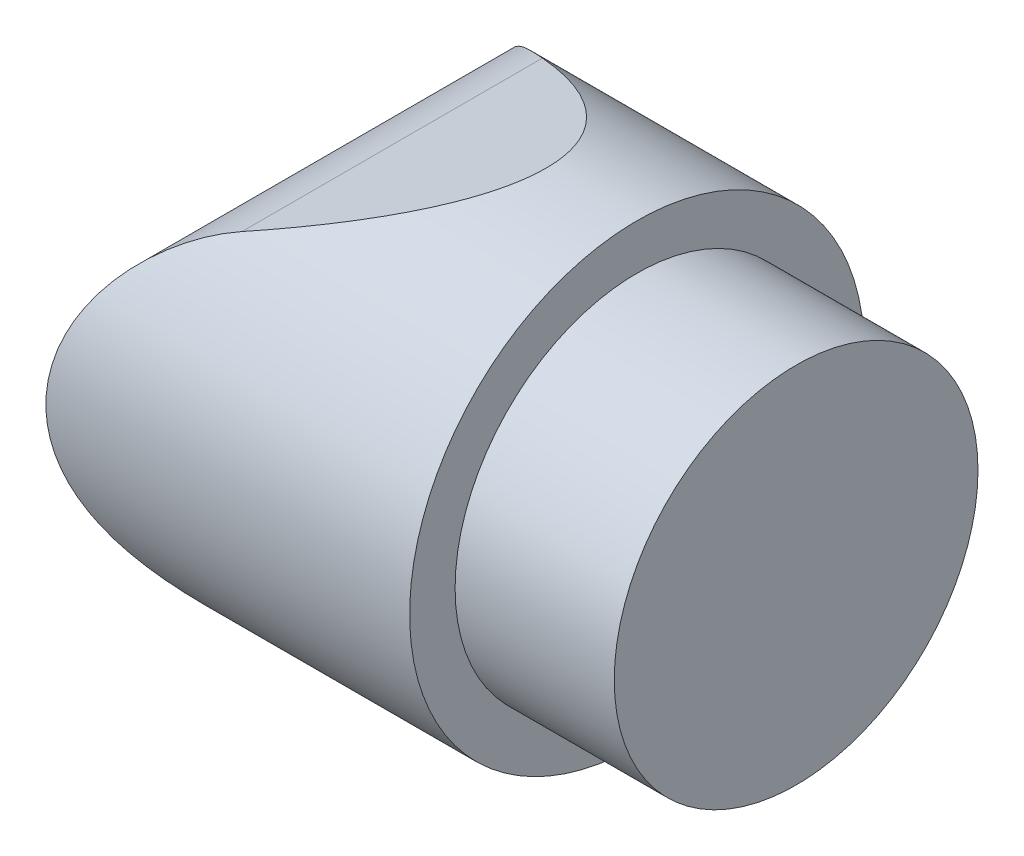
ISO-10303-21;
HEADER;
FILE_DESCRIPTION(('STEP AP214'),'2;1');
FILE_NAME('part.step','',(''),(''),'','','');
FILE_SCHEMA(('AUTOMOTIVE_DESIGN { 1 0 10303 214 1 1 1 1 }'));
ENDSEC;
DATA;
#1=APPLICATION_CONTEXT('core data for automotive mechanical design processes');
#2=APPLICATION_PROTOCOL_DEFINITION('international standard','automotive_design',2000,#1);
#3=PRODUCT_CONTEXT('',#1,'mechanical');
#4=PRODUCT('Part','Part','',(#3));
#5=PRODUCT_RELATED_PRODUCT_CATEGORY('part','',(#4));
#6=PRODUCT_DEFINITION_FORMATION('','',#4);
#7=PRODUCT_DEFINITION_CONTEXT('part definition',#1,'design');
#8=PRODUCT_DEFINITION('design','',#6,#7);
#9=PRODUCT_DEFINITION_SHAPE('','',#8);
#10=(LENGTH_UNIT() NAMED_UNIT(*) SI_UNIT(.MILLI.,.METRE.));
#11=(NAMED_UNIT(*) PLANE_ANGLE_UNIT() SI_UNIT($,.RADIAN.));
#12=(NAMED_UNIT(*) SI_UNIT($,.STERADIAN.) SOLID_ANGLE_UNIT());
#13=UNCERTAINTY_MEASURE_WITH_UNIT(LENGTH_MEASURE(1.E-05),#10,'distance_accuracy_value','');
#14=(GEOMETRIC_REPRESENTATION_CONTEXT(3) GLOBAL_UNCERTAINTY_ASSIGNED_CONTEXT((#13)) GLOBAL_UNIT_ASSIGNED_CONTEXT((#10,
#11,#12)) REPRESENTATION_CONTEXT('',''));
#15=CARTESIAN_POINT('',(0.,0.,0.));
#16=DIRECTION('',(0.,0.,1.));
#17=DIRECTION('',(1.,0.,0.));
#18=AXIS2_PLACEMENT_3D('',#15,#16,#17);
#19=CARTESIAN_POINT('',(0.,0.,-110.141421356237));
#20=DIRECTION('',(1.,0.,0.));
#21=DIRECTION('',(0.,0.,-1.));
#22=AXIS2_PLACEMENT_3D('',#19,#20,#21);
#23=PLANE('',#22);
#24=CARTESIAN_POINT('',(0.,0.,0.));
#25=DIRECTION('',(1.,0.,0.));
#26=DIRECTION('',(0.,0.,-1.));
#27=AXIS2_PLACEMENT_3D('',#24,#25,#26);
#28=CIRCLE('',#27,50.);
#29=CARTESIAN_POINT('',(0.,0.,-50.));
#30=VERTEX_POINT('',#29);
#31=EDGE_CURVE('E62',#30,#30,#28,.T.);
#32=ORIENTED_EDGE('',*,*,#31,.T.);
#33=EDGE_LOOP('',(#32));
#34=FACE_BOUND('',#33,.T.);
#35=CARTESIAN_POINT('',(0.,0.,0.));
#36=DIRECTION('',(1.,0.,0.));
#37=DIRECTION('',(0.,0.,-1.));
#38=AXIS2_PLACEMENT_3D('',#35,#36,#37);
#39=CIRCLE('',#38,40.);
#40=CARTESIAN_POINT('',(0.,0.,-40.));
#41=VERTEX_POINT('',#40);
#42=EDGE_CURVE('E70',#41,#41,#39,.T.);
#43=ORIENTED_EDGE('',*,*,#42,.F.);
#44=EDGE_LOOP('',(#43));
#45=FACE_BOUND('',#44,.T.);
#46=ADVANCED_FACE('F31',(#34,#45),#23,.T.);
#47=CARTESIAN_POINT('',(-100.,0.,0.));
#48=DIRECTION('',(1.,0.,0.));
#49=DIRECTION('',(0.,0.,-1.));
#50=AXIS2_PLACEMENT_3D('',#47,#48,#49);
#51=CYLINDRICAL_SURFACE('',#50,50.);
#52=CARTESIAN_POINT('',(-53.8313881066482,-37.5325552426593,33.0349405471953));
#53=CARTESIAN_POINT('',(-54.4122214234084,-37.3184792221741,33.2781937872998));
#54=CARTESIAN_POINT('',(-54.9846616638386,-37.0922393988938,33.5304396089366));
#55=CARTESIAN_POINT('',(-56.1127283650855,-36.6163241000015,34.04949578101));
#56=CARTESIAN_POINT('',(-56.6683600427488,-36.3666559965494,34.3163015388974));
#57=CARTESIAN_POINT('',(-57.7626277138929,-35.8448879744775,34.8609556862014));
#58=CARTESIAN_POINT('',(-58.301279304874,-35.5728095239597,35.1387933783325));
#59=CARTESIAN_POINT('',(-59.3623303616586,-35.0065961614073,35.702913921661));
#60=CARTESIAN_POINT('',(-59.8847283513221,-34.7124592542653,35.9891975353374));
#61=CARTESIAN_POINT('',(-61.4337549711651,-33.7941056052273,36.8601691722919));
#62=CARTESIAN_POINT('',(-62.4360387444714,-33.1369022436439,37.4538421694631));
#63=CARTESIAN_POINT('',(-64.3757445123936,-31.7372601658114,38.6470320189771));
#64=CARTESIAN_POINT('',(-65.3131471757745,-30.9947962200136,39.2465505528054));
#65=CARTESIAN_POINT('',(-67.1187591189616,-29.4278420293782,40.4347194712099));
#66=CARTESIAN_POINT('',(-67.9871454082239,-28.6035746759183,41.0233944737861));
#67=CARTESIAN_POINT('',(-69.6537549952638,-26.8718847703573,42.1780081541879));
#68=CARTESIAN_POINT('',(-70.4519805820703,-25.9644649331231,42.7439475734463));
#69=CARTESIAN_POINT('',(-71.5910002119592,-24.5433508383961,43.5651542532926));
#70=CARTESIAN_POINT('',(-71.9605622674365,-24.0602382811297,43.8339796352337));
#71=CARTESIAN_POINT('',(-72.6797932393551,-23.0738729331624,44.3611197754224));
#72=CARTESIAN_POINT('',(-73.0294634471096,-22.5706214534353,44.61943521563));
#73=CARTESIAN_POINT('',(-73.7077466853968,-21.5445095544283,45.1238387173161));
#74=CARTESIAN_POINT('',(-74.0363679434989,-21.0216569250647,45.3699315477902));
#75=CARTESIAN_POINT('',(-74.6716381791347,-19.9565067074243,45.8484334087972));
#76=CARTESIAN_POINT('',(-74.9782817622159,-19.4142043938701,46.0808390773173));
#77=CARTESIAN_POINT('',(-75.7076082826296,-18.0503399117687,46.6364022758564));
#78=CARTESIAN_POINT('',(-76.1167390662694,-17.2177933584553,46.9506128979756));
#79=CARTESIAN_POINT('',(-76.8803187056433,-15.5149052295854,47.5405001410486));
#80=CARTESIAN_POINT('',(-77.2347806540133,-14.6445727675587,47.816185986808));
#81=CARTESIAN_POINT('',(-77.7222008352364,-13.313858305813,48.1970353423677));
#82=CARTESIAN_POINT('',(-77.8772876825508,-12.8661110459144,48.3185324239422));
#83=CARTESIAN_POINT('',(-78.1722064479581,-11.9627923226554,48.5500670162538));
#84=CARTESIAN_POINT('',(-78.3120409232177,-11.5072221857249,48.660106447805));
#85=CARTESIAN_POINT('',(-78.7079443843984,-10.1295403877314,48.9722212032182));
#86=CARTESIAN_POINT('',(-78.9404509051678,-9.19635533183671,49.1563223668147));
#87=CARTESIAN_POINT('',(-79.3399731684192,-7.30137920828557,49.4734134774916));
#88=CARTESIAN_POINT('',(-79.5065739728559,-6.3394466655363,49.6060794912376));
#89=CARTESIAN_POINT('',(-79.7693132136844,-4.39990670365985,49.8155795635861));
#90=CARTESIAN_POINT('',(-79.8654517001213,-3.42229929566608,49.8924136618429));
#91=CARTESIAN_POINT('',(-79.9854249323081,-1.46006707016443,49.9883277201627));
#92=CARTESIAN_POINT('',(-80.0092772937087,-0.475444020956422,50.007421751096));
#93=CARTESIAN_POINT('',(-79.9842607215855,1.49224086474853,49.9874087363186));
#94=CARTESIAN_POINT('',(-79.9353970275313,2.47530280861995,49.9483058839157));
#95=CARTESIAN_POINT('',(-79.774156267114,4.33616655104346,49.8194887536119));
#96=CARTESIAN_POINT('',(-79.6684049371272,5.2149228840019,49.7350558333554));
#97=CARTESIAN_POINT('',(-79.400033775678,6.95808001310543,49.5212689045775));
#98=CARTESIAN_POINT('',(-79.2374183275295,7.82248191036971,49.3919183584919));
#99=CARTESIAN_POINT('',(-78.8576166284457,9.5316390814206,49.0907424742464));
#100=CARTESIAN_POINT('',(-78.6404284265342,10.3763936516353,48.9189156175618));
#101=CARTESIAN_POINT('',(-78.1542934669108,12.0416947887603,48.535839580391));
#102=CARTESIAN_POINT('',(-77.8853440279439,12.8622400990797,48.3245883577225));
#103=CARTESIAN_POINT('',(-77.2864594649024,14.5093010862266,47.8564907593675));
#104=CARTESIAN_POINT('',(-76.9544348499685,15.3346159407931,47.5981002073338));
#105=CARTESIAN_POINT('',(-76.241200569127,16.9515878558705,47.0465036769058));
#106=CARTESIAN_POINT('',(-75.8599901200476,17.7432443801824,46.7532971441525));
#107=CARTESIAN_POINT('',(-75.0518031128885,19.2907613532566,46.1363277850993));
#108=CARTESIAN_POINT('',(-74.6248102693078,20.0466089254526,45.8125540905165));
#109=CARTESIAN_POINT('',(-73.7283898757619,21.520686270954,45.1388613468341));
#110=CARTESIAN_POINT('',(-73.2589564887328,22.2389108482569,44.7889387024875));
#111=CARTESIAN_POINT('',(-72.4812671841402,23.3499599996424,44.2153230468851));
#112=CARTESIAN_POINT('',(-72.185813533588,23.7554964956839,43.9986786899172));
#113=CARTESIAN_POINT('',(-71.5817837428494,24.5528209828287,43.5587679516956));
#114=CARTESIAN_POINT('',(-71.2732101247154,24.9446115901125,43.3355028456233));
#115=CARTESIAN_POINT('',(-70.3283731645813,26.0994124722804,42.6569775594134));
#116=CARTESIAN_POINT('',(-69.6730041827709,26.8418368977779,42.1929951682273));
#117=CARTESIAN_POINT('',(-68.3144852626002,28.2712383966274,41.2488943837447));
#118=CARTESIAN_POINT('',(-67.611309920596,28.9581855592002,40.7687674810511));
#119=CARTESIAN_POINT('',(-66.1596380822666,30.2759697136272,39.7999289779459));
#120=CARTESIAN_POINT('',(-65.4111380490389,30.906802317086,39.311216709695));
#121=CARTESIAN_POINT('',(-63.8352911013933,32.1391428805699,38.3110096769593));
#122=CARTESIAN_POINT('',(-63.005907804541,32.7380231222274,37.7994869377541));
#123=CARTESIAN_POINT('',(-61.2997344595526,33.872862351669,36.785966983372));
#124=CARTESIAN_POINT('',(-60.422954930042,34.4088352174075,36.2839676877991));
#125=CARTESIAN_POINT('',(-59.0725179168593,35.1639661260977,35.5474227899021));
#126=CARTESIAN_POINT('',(-58.6167175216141,35.4074350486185,35.3047607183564));
#127=CARTESIAN_POINT('',(-57.6930537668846,35.8779106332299,34.826541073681));
#128=CARTESIAN_POINT('',(-57.2251911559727,36.104918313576,34.5909830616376));
#129=CARTESIAN_POINT('',(-56.276908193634,36.5422381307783,34.1286695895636));
#130=CARTESIAN_POINT('',(-55.796478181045,36.7525368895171,33.9019212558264));
#131=CARTESIAN_POINT('',(-54.8232258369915,37.1557422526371,33.4595386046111));
#132=CARTESIAN_POINT('',(-54.3304008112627,37.3486450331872,33.2439067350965));
#133=CARTESIAN_POINT('',(-53.8313881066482,37.5325552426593,33.0349405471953));
#134=B_SPLINE_CURVE_WITH_KNOTS('',3,(#52,#53,#54,#55,#56,#57,#58,#59,#60,#61,#62,#63,#64,#65,
#66,#67,#68,#69,#70,#71,#72,#73,#74,#75,#76,#77,#78,#79,#80,#81,#82,#83,#84,#85,#86,#87,#88,#89,
#90,#91,#92,#93,#94,#95,#96,#97,#98,#99,#100,#101,#102,#103,#104,#105,#106,#107,#108,#109,#110,
#111,#112,#113,#114,#115,#116,#117,#118,#119,#120,#121,#122,#123,#124,#125,#126,#127,#128,#129,
#130,#131,#132,#133),.UNSPECIFIED.,.F.,.F.,(4,2,2,2,2,2,2,2,2,2,2,2,2,2,2,2,2,2,2,2,2,2,2,2,2,2,
2,2,2,2,2,2,2,2,2,2,2,2,2,2,4),(0.,1.99491349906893,3.98920135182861,5.98160050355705,
7.97418007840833,11.9818640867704,15.9907370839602,19.9889722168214,23.9870768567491,
25.9815500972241,27.9758937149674,29.9694529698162,31.9634998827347,34.8988225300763,
37.83344110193,39.3005792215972,40.7674709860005,43.7009178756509,46.6525503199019,
49.6041806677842,52.5550916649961,55.5057900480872,58.1700612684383,60.8341271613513,
63.4982883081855,66.1625874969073,68.9389621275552,71.7153809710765,74.4927907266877,
77.2705830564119,78.9098123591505,80.5487279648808,83.826618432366,87.106264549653,
90.3861669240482,93.8148303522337,97.2427359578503,98.9550746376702,100.667307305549,
102.380897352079,104.094863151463),.UNSPECIFIED.);
#135=CARTESIAN_POINT('',(-53.8313881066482,-37.5325552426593,33.0349405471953));
#136=VERTEX_POINT('',#135);
#137=CARTESIAN_POINT('',(-53.8313881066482,37.5325552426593,33.0349405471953));
#138=VERTEX_POINT('',#137);
#139=EDGE_CURVE('E51',#136,#138,#134,.T.);
#140=ORIENTED_EDGE('',*,*,#139,.F.);
#141=CARTESIAN_POINT('',(-155.678917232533,0.,0.));
#142=DIRECTION('',(0.345784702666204,0.938313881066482,0.));
#143=DIRECTION('',(0.938313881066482,-0.345784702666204,0.));
#144=AXIS2_PLACEMENT_3D('',#141,#142,#143);
#145=ELLIPSE('',#144,144.598646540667,50.);
#146=CARTESIAN_POINT('',(-53.8313881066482,-37.5325552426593,-33.0349405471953));
#147=VERTEX_POINT('',#146);
#148=EDGE_CURVE('E11',#147,#136,#145,.F.);
#149=ORIENTED_EDGE('',*,*,#148,.F.);
#150=CARTESIAN_POINT('',(-53.8313881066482,37.5325552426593,-33.0349405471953));
#151=CARTESIAN_POINT('',(-54.4122214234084,37.3184792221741,-33.2781937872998));
#152=CARTESIAN_POINT('',(-54.9846616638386,37.0922393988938,-33.5304396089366));
#153=CARTESIAN_POINT('',(-56.1127283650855,36.6163241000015,-34.04949578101));
#154=CARTESIAN_POINT('',(-56.6683600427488,36.3666559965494,-34.3163015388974));
#155=CARTESIAN_POINT('',(-57.7626277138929,35.8448879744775,-34.8609556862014));
#156=CARTESIAN_POINT('',(-58.301279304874,35.5728095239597,-35.1387933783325));
#157=CARTESIAN_POINT('',(-59.3623303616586,35.0065961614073,-35.702913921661));
#158=CARTESIAN_POINT('',(-59.8847283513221,34.7124592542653,-35.9891975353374));
#159=CARTESIAN_POINT('',(-61.4337549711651,33.7941056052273,-36.8601691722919));
#160=CARTESIAN_POINT('',(-62.4360387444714,33.1369022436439,-37.4538421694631));
#161=CARTESIAN_POINT('',(-64.3757445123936,31.7372601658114,-38.6470320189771));
#162=CARTESIAN_POINT('',(-65.3131471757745,30.9947962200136,-39.2465505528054));
#163=CARTESIAN_POINT('',(-67.1187591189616,29.4278420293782,-40.4347194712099));
#164=CARTESIAN_POINT('',(-67.9871454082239,28.6035746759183,-41.0233944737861));
#165=CARTESIAN_POINT('',(-69.6537549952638,26.8718847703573,-42.1780081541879));
#166=CARTESIAN_POINT('',(-70.4519805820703,25.9644649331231,-42.7439475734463));
#167=CARTESIAN_POINT('',(-71.5910002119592,24.5433508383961,-43.5651542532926));
#168=CARTESIAN_POINT('',(-71.9605622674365,24.0602382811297,-43.8339796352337));
#169=CARTESIAN_POINT('',(-72.6797932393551,23.0738729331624,-44.3611197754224));
#170=CARTESIAN_POINT('',(-73.0294634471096,22.5706214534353,-44.61943521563));
#171=CARTESIAN_POINT('',(-73.7077466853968,21.5445095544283,-45.1238387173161));
#172=CARTESIAN_POINT('',(-74.0363679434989,21.0216569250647,-45.3699315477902));
#173=CARTESIAN_POINT('',(-74.6716381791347,19.9565067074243,-45.8484334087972));
#174=CARTESIAN_POINT('',(-74.9782817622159,19.4142043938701,-46.0808390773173));
#175=CARTESIAN_POINT('',(-75.7076082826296,18.0503399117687,-46.6364022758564));
#176=CARTESIAN_POINT('',(-76.1167390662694,17.2177933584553,-46.9506128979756));
#177=CARTESIAN_POINT('',(-76.8803187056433,15.5149052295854,-47.5405001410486));
#178=CARTESIAN_POINT('',(-77.2347806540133,14.6445727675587,-47.816185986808));
#179=CARTESIAN_POINT('',(-77.7222008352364,13.313858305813,-48.1970353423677));
#180=CARTESIAN_POINT('',(-77.8772876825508,12.8661110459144,-48.3185324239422));
#181=CARTESIAN_POINT('',(-78.1722064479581,11.9627923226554,-48.5500670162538));
#182=CARTESIAN_POINT('',(-78.3120409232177,11.5072221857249,-48.660106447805));
#183=CARTESIAN_POINT('',(-78.7079443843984,10.1295403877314,-48.9722212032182));
#184=CARTESIAN_POINT('',(-78.9404509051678,9.19635533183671,-49.1563223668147));
#185=CARTESIAN_POINT('',(-79.3399731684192,7.30137920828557,-49.4734134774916));
#186=CARTESIAN_POINT('',(-79.5065739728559,6.3394466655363,-49.6060794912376));
#187=CARTESIAN_POINT('',(-79.7693132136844,4.39990670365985,-49.8155795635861));
#188=CARTESIAN_POINT('',(-79.8654517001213,3.42229929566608,-49.8924136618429));
#189=CARTESIAN_POINT('',(-79.9854249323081,1.46006707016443,-49.9883277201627));
#190=CARTESIAN_POINT('',(-80.0092772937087,0.475444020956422,-50.007421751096));
#191=CARTESIAN_POINT('',(-79.9842607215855,-1.49224086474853,-49.9874087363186));
#192=CARTESIAN_POINT('',(-79.9353970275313,-2.47530280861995,-49.9483058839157));
#193=CARTESIAN_POINT('',(-79.774156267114,-4.33616655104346,-49.8194887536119));
#194=CARTESIAN_POINT('',(-79.6684049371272,-5.2149228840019,-49.7350558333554));
#195=CARTESIAN_POINT('',(-79.400033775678,-6.95808001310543,-49.5212689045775));
#196=CARTESIAN_POINT('',(-79.2374183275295,-7.82248191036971,-49.3919183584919));
#197=CARTESIAN_POINT('',(-78.8576166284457,-9.5316390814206,-49.0907424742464));
#198=CARTESIAN_POINT('',(-78.6404284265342,-10.3763936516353,-48.9189156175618));
#199=CARTESIAN_POINT('',(-78.1542934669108,-12.0416947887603,-48.535839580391));
#200=CARTESIAN_POINT('',(-77.8853440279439,-12.8622400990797,-48.3245883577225));
#201=CARTESIAN_POINT('',(-77.2864594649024,-14.5093010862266,-47.8564907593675));
#202=CARTESIAN_POINT('',(-76.9544348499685,-15.3346159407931,-47.5981002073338));
#203=CARTESIAN_POINT('',(-76.241200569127,-16.9515878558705,-47.0465036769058));
#204=CARTESIAN_POINT('',(-75.8599901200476,-17.7432443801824,-46.7532971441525));
#205=CARTESIAN_POINT('',(-75.0518031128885,-19.2907613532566,-46.1363277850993));
#206=CARTESIAN_POINT('',(-74.6248102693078,-20.0466089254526,-45.8125540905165));
#207=CARTESIAN_POINT('',(-73.7283898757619,-21.520686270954,-45.1388613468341));
#208=CARTESIAN_POINT('',(-73.2589564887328,-22.2389108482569,-44.7889387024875));
#209=CARTESIAN_POINT('',(-72.4812671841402,-23.3499599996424,-44.2153230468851));
#210=CARTESIAN_POINT('',(-72.185813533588,-23.7554964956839,-43.9986786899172));
#211=CARTESIAN_POINT('',(-71.5817837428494,-24.5528209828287,-43.5587679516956));
#212=CARTESIAN_POINT('',(-71.2732101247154,-24.9446115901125,-43.3355028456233));
#213=CARTESIAN_POINT('',(-70.3283731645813,-26.0994124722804,-42.6569775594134));
#214=CARTESIAN_POINT('',(-69.6730041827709,-26.8418368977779,-42.1929951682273));
#215=CARTESIAN_POINT('',(-68.3144852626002,-28.2712383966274,-41.2488943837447));
#216=CARTESIAN_POINT('',(-67.611309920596,-28.9581855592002,-40.7687674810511));
#217=CARTESIAN_POINT('',(-66.1596380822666,-30.2759697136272,-39.7999289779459));
#218=CARTESIAN_POINT('',(-65.4111380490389,-30.906802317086,-39.311216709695));
#219=CARTESIAN_POINT('',(-63.8352911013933,-32.1391428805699,-38.3110096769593));
#220=CARTESIAN_POINT('',(-63.005907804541,-32.7380231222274,-37.7994869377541));
#221=CARTESIAN_POINT('',(-61.2997344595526,-33.872862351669,-36.785966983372));
#222=CARTESIAN_POINT('',(-60.422954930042,-34.4088352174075,-36.2839676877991));
#223=CARTESIAN_POINT('',(-59.0725179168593,-35.1639661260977,-35.5474227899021));
#224=CARTESIAN_POINT('',(-58.6167175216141,-35.4074350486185,-35.3047607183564));
#225=CARTESIAN_POINT('',(-57.6930537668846,-35.8779106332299,-34.826541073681));
#226=CARTESIAN_POINT('',(-57.2251911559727,-36.104918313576,-34.5909830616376));
#227=CARTESIAN_POINT('',(-56.276908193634,-36.5422381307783,-34.1286695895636));
#228=CARTESIAN_POINT('',(-55.796478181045,-36.7525368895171,-33.9019212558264));
#229=CARTESIAN_POINT('',(-54.8232258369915,-37.1557422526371,-33.4595386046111));
#230=CARTESIAN_POINT('',(-54.3304008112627,-37.3486450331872,-33.2439067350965));
#231=CARTESIAN_POINT('',(-53.8313881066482,-37.5325552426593,-33.0349405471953));
#232=B_SPLINE_CURVE_WITH_KNOTS('',3,(#150,#151,#152,#153,#154,#155,#156,#157,#158,#159,#160,
#161,#162,#163,#164,#165,#166,#167,#168,#169,#170,#171,#172,#173,#174,#175,#176,#177,#178,#179,
#180,#181,#182,#183,#184,#185,#186,#187,#188,#189,#190,#191,#192,#193,#194,#195,#196,#197,#198,
#199,#200,#201,#202,#203,#204,#205,#206,#207,#208,#209,#210,#211,#212,#213,#214,#215,#216,#217,
#218,#219,#220,#221,#222,#223,#224,#225,#226,#227,#228,#229,#230,#231),.UNSPECIFIED.,.F.,.F.,(4,
2,2,2,2,2,2,2,2,2,2,2,2,2,2,2,2,2,2,2,2,2,2,2,2,2,2,2,2,2,2,2,2,2,2,2,2,2,2,2,4),(0.,
1.99491349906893,3.98920135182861,5.98160050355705,7.97418007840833,11.9818640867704,
15.9907370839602,19.9889722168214,23.9870768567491,25.9815500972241,27.9758937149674,
29.9694529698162,31.9634998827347,34.8988225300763,37.83344110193,39.3005792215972,
40.7674709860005,43.7009178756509,46.6525503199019,49.6041806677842,52.5550916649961,
55.5057900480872,58.1700612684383,60.8341271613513,63.4982883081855,66.1625874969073,
68.9389621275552,71.7153809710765,74.4927907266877,77.2705830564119,78.9098123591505,
80.5487279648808,83.826618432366,87.106264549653,90.3861669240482,93.8148303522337,
97.2427359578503,98.9550746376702,100.667307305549,102.380897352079,104.094863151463),.UNSPECIFIED.);
#233=CARTESIAN_POINT('',(-53.8313881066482,37.5325552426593,-33.0349405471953));
#234=VERTEX_POINT('',#233);
#235=EDGE_CURVE('E40',#234,#147,#232,.T.);
#236=ORIENTED_EDGE('',*,*,#235,.F.);
#237=CARTESIAN_POINT('',(-155.678917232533,0.,0.));
#238=DIRECTION('',(0.345784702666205,-0.938313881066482,0.));
#239=DIRECTION('',(0.938313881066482,0.345784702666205,0.));
#240=AXIS2_PLACEMENT_3D('',#237,#238,#239);
#241=ELLIPSE('',#240,144.598646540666,50.);
#242=EDGE_CURVE('E61',#138,#234,#241,.F.);
#243=ORIENTED_EDGE('',*,*,#242,.F.);
#244=EDGE_LOOP('',(#140,#149,#236,#243));
#245=FACE_BOUND('',#244,.T.);
#246=ORIENTED_EDGE('',*,*,#31,.F.);
#247=EDGE_LOOP('',(#246));
#248=FACE_BOUND('',#247,.T.);
#249=ADVANCED_FACE('F33',(#245,#248),#51,.T.);
#250=CARTESIAN_POINT('',(35.,0.,0.));
#251=DIRECTION('',(-1.,0.,0.));
#252=DIRECTION('',(0.,0.,1.));
#253=AXIS2_PLACEMENT_3D('',#250,#251,#252);
#254=CYLINDRICAL_SURFACE('',#253,40.);
#255=CARTESIAN_POINT('',(35.,0.,0.));
#256=DIRECTION('',(1.,0.,0.));
#257=DIRECTION('',(0.,0.,-1.));
#258=AXIS2_PLACEMENT_3D('',#255,#256,#257);
#259=CIRCLE('',#258,40.);
#260=CARTESIAN_POINT('',(35.,0.,-40.));
#261=VERTEX_POINT('',#260);
#262=EDGE_CURVE('E73',#261,#261,#259,.T.);
#263=ORIENTED_EDGE('',*,*,#262,.F.);
#264=EDGE_LOOP('',(#263));
#265=FACE_BOUND('',#264,.T.);
#266=ORIENTED_EDGE('',*,*,#42,.T.);
#267=EDGE_LOOP('',(#266));
#268=FACE_BOUND('',#267,.T.);
#269=ADVANCED_FACE('F100',(#265,#268),#254,.T.);
#270=CARTESIAN_POINT('',(35.,0.,-110.141421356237));
#271=DIRECTION('',(1.,0.,0.));
#272=DIRECTION('',(0.,0.,-1.));
#273=AXIS2_PLACEMENT_3D('',#270,#271,#272);
#274=PLANE('',#273);
#275=ORIENTED_EDGE('',*,*,#262,.T.);
#276=EDGE_LOOP('',(#275));
#277=FACE_BOUND('',#276,.T.);
#278=ADVANCED_FACE('F96',(#277),#274,.T.);
#279=CARTESIAN_POINT('',(-20.,50.,-50.));
#280=DIRECTION('',(0.345784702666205,-0.938313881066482,0.));
#281=DIRECTION('',(0.938313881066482,0.345784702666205,0.));
#282=AXIS2_PLACEMENT_3D('',#279,#280,#281);
#283=PLANE('',#282);
#284=ORIENTED_EDGE('',*,*,#242,.T.);
#285=DIRECTION('',(0.,0.,1.));
#286=VECTOR('',#285,1.);
#287=CARTESIAN_POINT('',(-53.8313881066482,37.5325552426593,-50.));
#288=LINE('',#287,#286);
#289=EDGE_CURVE('E68',#234,#138,#288,.T.);
#290=ORIENTED_EDGE('',*,*,#289,.T.);
#291=EDGE_LOOP('',(#284,#290));
#292=FACE_BOUND('',#291,.T.);
#293=ADVANCED_FACE('F88',(#292),#283,.F.);
#294=CARTESIAN_POINT('',(-40.,0.,-50.));
#295=DIRECTION('',(0.,0.,1.));
#296=DIRECTION('',(1.,0.,0.));
#297=AXIS2_PLACEMENT_3D('',#294,#295,#296);
#298=CYLINDRICAL_SURFACE('',#297,40.);
#299=DIRECTION('',(0.,0.,1.));
#300=VECTOR('',#299,1.);
#301=CARTESIAN_POINT('',(-53.8313881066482,-37.5325552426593,-50.));
#302=LINE('',#301,#300);
#303=EDGE_CURVE('E66',#147,#136,#302,.T.);
#304=ORIENTED_EDGE('',*,*,#303,.T.);
#305=ORIENTED_EDGE('',*,*,#139,.T.);
#306=ORIENTED_EDGE('',*,*,#289,.F.);
#307=ORIENTED_EDGE('',*,*,#235,.T.);
#308=EDGE_LOOP('',(#304,#305,#306,#307));
#309=FACE_BOUND('',#308,.T.);
#310=ADVANCED_FACE('F67',(#309),#298,.T.);
#311=CARTESIAN_POINT('',(-53.8313881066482,-37.5325552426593,-50.));
#312=DIRECTION('',(0.345784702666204,0.938313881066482,0.));
#313=DIRECTION('',(-0.938313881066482,0.345784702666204,0.));
#314=AXIS2_PLACEMENT_3D('',#311,#312,#313);
#315=PLANE('',#314);
#316=ORIENTED_EDGE('',*,*,#148,.T.);
#317=ORIENTED_EDGE('',*,*,#303,.F.);
#318=EDGE_LOOP('',(#316,#317));
#319=FACE_BOUND('',#318,.T.);
#320=ADVANCED_FACE('F65',(#319),#315,.F.);
#321=CLOSED_SHELL('',(#46,#249,#269,#278,#293,#310,#320));
#322=MANIFOLD_SOLID_BREP('B2',#321);
#323=ADVANCED_BREP_SHAPE_REPRESENTATION('',(#18,#322),#14);
#324=SHAPE_DEFINITION_REPRESENTATION(#9,#323);
ENDSEC;
END-ISO-10303-21;
